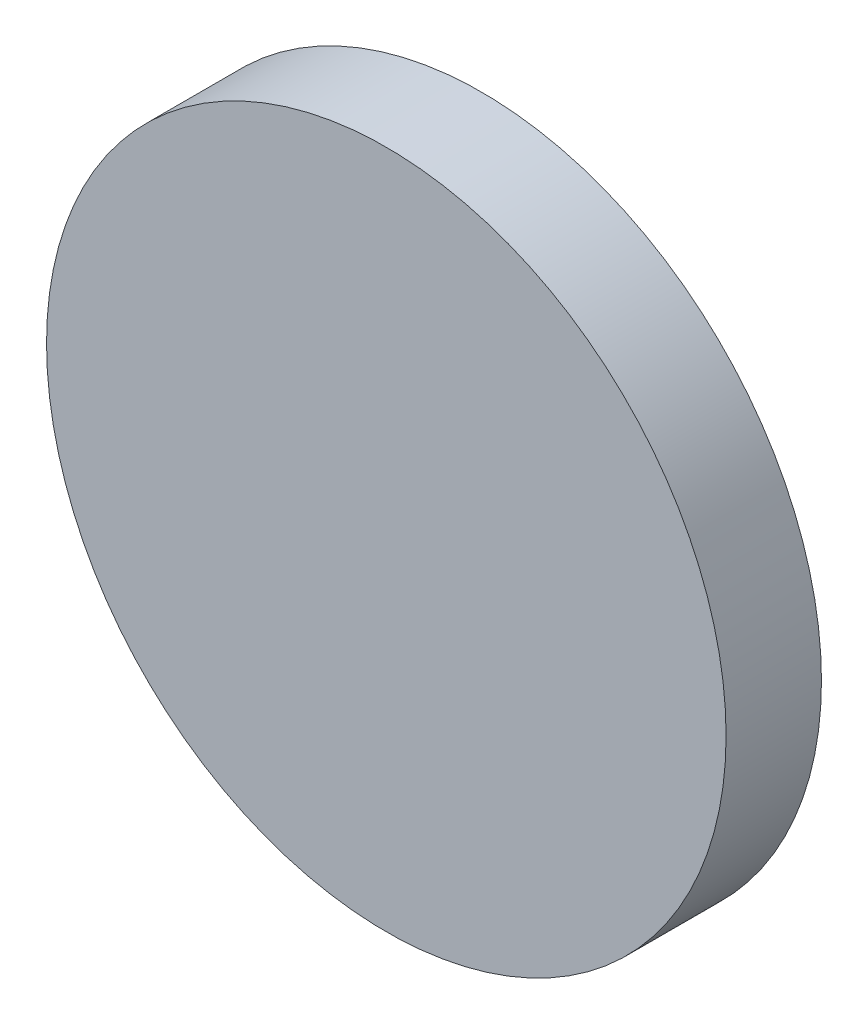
ISO-10303-21;
HEADER;
FILE_DESCRIPTION(('STEP AP214'),'2;1');
FILE_NAME('part.step','',(''),(''),'','','');
FILE_SCHEMA(('AUTOMOTIVE_DESIGN { 1 0 10303 214 1 1 1 1 }'));
ENDSEC;
DATA;
#1=APPLICATION_CONTEXT('core data for automotive mechanical design processes');
#2=APPLICATION_PROTOCOL_DEFINITION('international standard','automotive_design',2000,#1);
#3=PRODUCT_CONTEXT('',#1,'mechanical');
#4=PRODUCT('Part','Part','',(#3));
#5=PRODUCT_RELATED_PRODUCT_CATEGORY('part','',(#4));
#6=PRODUCT_DEFINITION_FORMATION('','',#4);
#7=PRODUCT_DEFINITION_CONTEXT('part definition',#1,'design');
#8=PRODUCT_DEFINITION('design','',#6,#7);
#9=PRODUCT_DEFINITION_SHAPE('','',#8);
#10=(LENGTH_UNIT() NAMED_UNIT(*) SI_UNIT(.MILLI.,.METRE.));
#11=(NAMED_UNIT(*) PLANE_ANGLE_UNIT() SI_UNIT($,.RADIAN.));
#12=(NAMED_UNIT(*) SI_UNIT($,.STERADIAN.) SOLID_ANGLE_UNIT());
#13=UNCERTAINTY_MEASURE_WITH_UNIT(LENGTH_MEASURE(1.E-05),#10,'distance_accuracy_value','');
#14=(GEOMETRIC_REPRESENTATION_CONTEXT(3) GLOBAL_UNCERTAINTY_ASSIGNED_CONTEXT((#13)) GLOBAL_UNIT_ASSIGNED_CONTEXT((#10,
#11,#12)) REPRESENTATION_CONTEXT('',''));
#15=CARTESIAN_POINT('',(0.,0.,0.));
#16=DIRECTION('',(0.,0.,1.));
#17=DIRECTION('',(1.,0.,0.));
#18=AXIS2_PLACEMENT_3D('',#15,#16,#17);
#19=CARTESIAN_POINT('',(0.,0.,1.8288));
#20=DIRECTION('',(0.,0.,-1.));
#21=DIRECTION('',(-1.,0.,0.));
#22=AXIS2_PLACEMENT_3D('',#19,#20,#21);
#23=CYLINDRICAL_SURFACE('',#22,6.5151);
#24=CARTESIAN_POINT('',(0.,0.,1.8288));
#25=DIRECTION('',(0.,0.,1.));
#26=DIRECTION('',(1.,0.,0.));
#27=AXIS2_PLACEMENT_3D('',#24,#25,#26);
#28=CIRCLE('',#27,6.5151);
#29=CARTESIAN_POINT('',(6.5151,0.,1.8288));
#30=VERTEX_POINT('',#29);
#31=EDGE_CURVE('E10',#30,#30,#28,.T.);
#32=ORIENTED_EDGE('',*,*,#31,.F.);
#33=EDGE_LOOP('',(#32));
#34=FACE_BOUND('',#33,.T.);
#35=CARTESIAN_POINT('',(0.,0.,0.));
#36=DIRECTION('',(0.,0.,1.));
#37=DIRECTION('',(1.,0.,0.));
#38=AXIS2_PLACEMENT_3D('',#35,#36,#37);
#39=CIRCLE('',#38,6.5151);
#40=CARTESIAN_POINT('',(6.5151,0.,0.));
#41=VERTEX_POINT('',#40);
#42=EDGE_CURVE('E35',#41,#41,#39,.T.);
#43=ORIENTED_EDGE('',*,*,#42,.T.);
#44=EDGE_LOOP('',(#43));
#45=FACE_BOUND('',#44,.T.);
#46=ADVANCED_FACE('F32',(#34,#45),#23,.T.);
#47=CARTESIAN_POINT('',(0.,0.,1.8288));
#48=DIRECTION('',(0.,0.,1.));
#49=DIRECTION('',(1.,0.,0.));
#50=AXIS2_PLACEMENT_3D('',#47,#48,#49);
#51=PLANE('',#50);
#52=ORIENTED_EDGE('',*,*,#31,.T.);
#53=EDGE_LOOP('',(#52));
#54=FACE_BOUND('',#53,.T.);
#55=ADVANCED_FACE('F47',(#54),#51,.T.);
#56=CARTESIAN_POINT('',(0.,0.,0.));
#57=DIRECTION('',(0.,0.,1.));
#58=DIRECTION('',(1.,0.,0.));
#59=AXIS2_PLACEMENT_3D('',#56,#57,#58);
#60=PLANE('',#59);
#61=ORIENTED_EDGE('',*,*,#42,.F.);
#62=EDGE_LOOP('',(#61));
#63=FACE_BOUND('',#62,.T.);
#64=ADVANCED_FACE('F45',(#63),#60,.F.);
#65=CLOSED_SHELL('',(#46,#55,#64));
#66=MANIFOLD_SOLID_BREP('B2',#65);
#67=ADVANCED_BREP_SHAPE_REPRESENTATION('',(#18,#66),#14);
#68=SHAPE_DEFINITION_REPRESENTATION(#9,#67);
ENDSEC;
END-ISO-10303-21;
